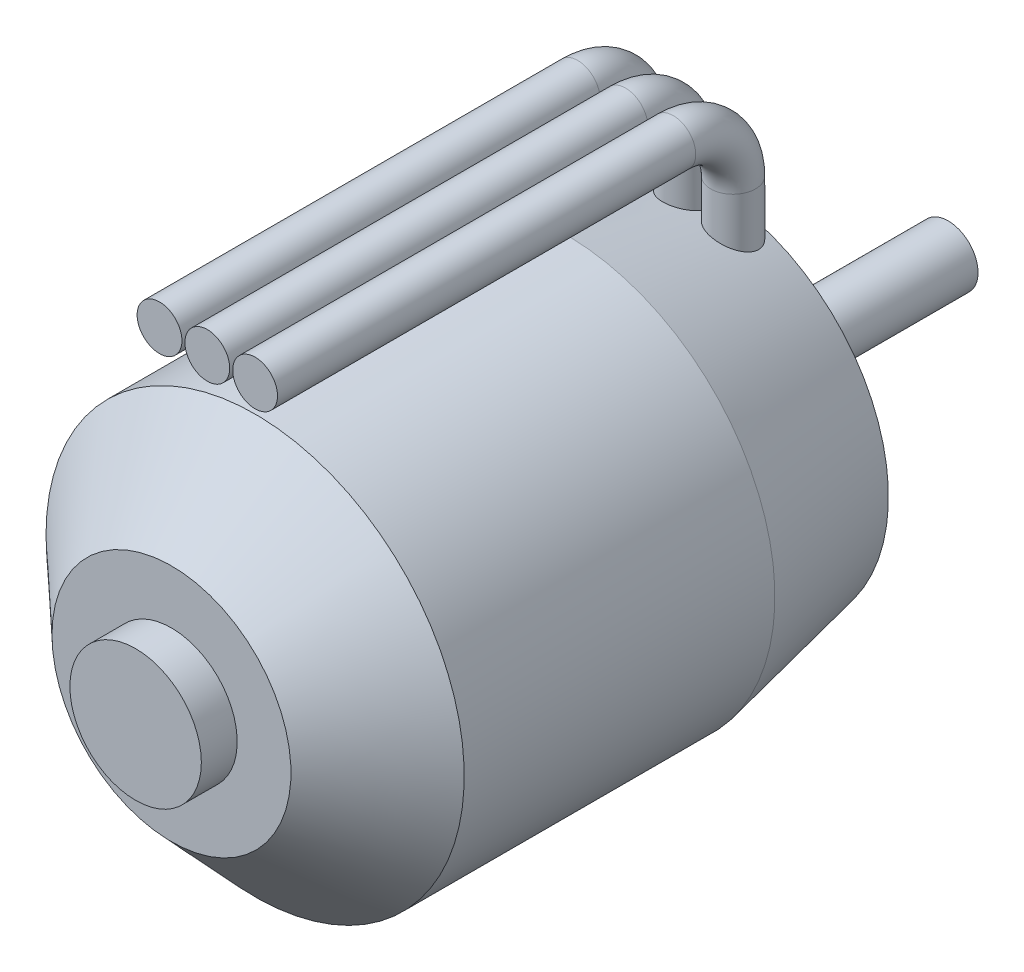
from build123d import *

# Parameters (mm, degrees)
ESQUISSE1_R           = 17.5
EXTRUSION1_DEPTH      = 26
ESQUISSE2_R           = 15
ESQUISSE3_R           = 17.5
ESQUISSE4_R           = 10
ESQUISSE5_R           = 17.5
ESQUISSE6_R           = 5.5
EXTRUSION2_DEPTH      = 3
ESQUISSE7_R           = 3.5
EXTRUSION3_DEPTH      = 1
ESQUISSE8_R           = 2.5
EXTRUSION4_DEPTH      = 19
TROU_TARAUD_M31_D     = 2.5
TROU_TARAUD_M31_DEPTH = 6.5
TROU_TARAUD_M31_TIP   = 0.751075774
ESQUISSE11_R          = 1.875


with BuildPart() as part:
    # Esquisse1 → Extrusion1 (new body)
    with BuildSketch(Plane.XY):
        with Locations(Location((0, 0, 0), (0, 0, 180))):
            Circle(ESQUISSE1_R)
    extrude(amount=EXTRUSION1_DEPTH)

    # Esquisse2 → Lissage1 section 0
    with BuildSketch(Plane(origin=(0, 0, -12), x_dir=(-1, 0, 0), z_dir=(0, 0, -1))):
        Circle(ESQUISSE2_R)
    # Esquisse3 → Lissage1 section 1
    with BuildSketch(Plane(origin=(0, 0, 0), x_dir=(-1, 0, 0), z_dir=(0, 0, -1))):
        Circle(ESQUISSE3_R)
    loft()

    # Esquisse4 → Lissage2 section 0
    with BuildSketch(Plane(origin=(0, 0, 33), x_dir=(-1, 0, 0), z_dir=(0, 0, -1))):
        Circle(ESQUISSE4_R)
    # Esquisse5 → Lissage2 section 1
    with BuildSketch(Plane.XY.offset(26)):
        Circle(ESQUISSE5_R)
    loft()

    # Esquisse6 → Extrusion2 (add)
    with BuildSketch(Plane.XY.offset(33)):
        with Locations(Location((0, 0, 0), (0, 0, 180))):
            Circle(ESQUISSE6_R)
    extrude(amount=EXTRUSION2_DEPTH)

    # Esquisse7 → Extrusion3 (add)
    with BuildSketch(Plane(origin=(0, 0, -12), x_dir=(-1, 0, 0), z_dir=(0, 0, -1))):
        Circle(ESQUISSE7_R)
    extrude(amount=EXTRUSION3_DEPTH)

    # Esquisse8 → Extrusion4 (add)
    with BuildSketch(Plane(origin=(0, 0, -13), x_dir=(-1, 0, 0), z_dir=(0, 0, -1))):
        Circle(ESQUISSE8_R)
    extrude(amount=EXTRUSION4_DEPTH)

    # Trou taraud_ M31
    with Locations(Plane(origin=(0, 0, -12), x_dir=(-1, 0, 0), z_dir=(0, 0, -1))):
        with Locations((-8.838834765, 8.838834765), (8.838834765, 8.838834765), (8.838834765, -8.838834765), (-8.838834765, -8.838834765)):
            Hole(TROU_TARAUD_M31_D / 2, depth=TROU_TARAUD_M31_DEPTH)
            with Locations((0, 0, -(TROU_TARAUD_M31_DEPTH + TROU_TARAUD_M31_TIP / 2))):  # 118° drill point
                Cone(0, TROU_TARAUD_M31_D / 2, TROU_TARAUD_M31_TIP, mode=Mode.SUBTRACT)

    # Balayage1: sweep along a curve in space
    with BuildLine() as balayage1_path:
        Line((0, 13, -10), (0, 18.75, -10))
        ThreePointArc((0, 18.75, -10), (0, 22.285533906, -8.535533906), (0, 23.75, -5))
        Line((0, 23.75, -5), (0, 23.75, 30))
    # Esquisse11 → Balayage1 (sweep)
    with BuildSketch(Plane(origin=(0, 23.75, 30), x_dir=(1, 0, 0), z_dir=(0, 0, 1))):
        with Locations((-4, 0)):
            Circle(ESQUISSE11_R)
        Circle(ESQUISSE11_R)
        with Locations((4, 0)):
            Circle(ESQUISSE11_R)
    sweep(path=balayage1_path.line)


solid = part.part
